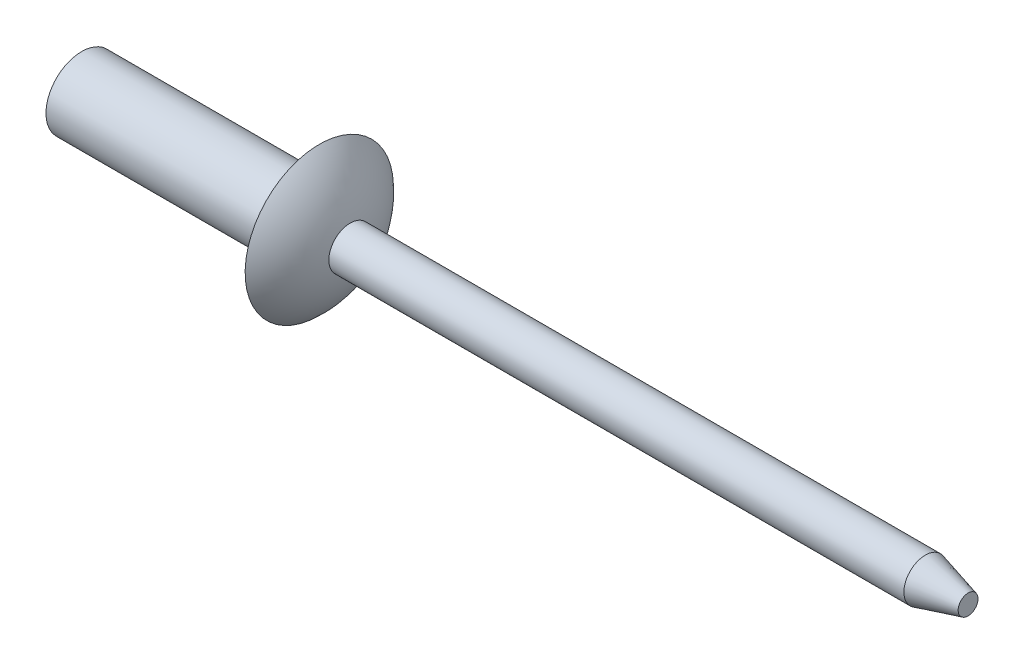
ISO-10303-21;
HEADER;
FILE_DESCRIPTION(('STEP AP214'),'2;1');
FILE_NAME('part.step','',(''),(''),'','','');
FILE_SCHEMA(('AUTOMOTIVE_DESIGN { 1 0 10303 214 1 1 1 1 }'));
ENDSEC;
DATA;
#1=APPLICATION_CONTEXT('core data for automotive mechanical design processes');
#2=APPLICATION_PROTOCOL_DEFINITION('international standard','automotive_design',2000,#1);
#3=PRODUCT_CONTEXT('',#1,'mechanical');
#4=PRODUCT('Part','Part','',(#3));
#5=PRODUCT_RELATED_PRODUCT_CATEGORY('part','',(#4));
#6=PRODUCT_DEFINITION_FORMATION('','',#4);
#7=PRODUCT_DEFINITION_CONTEXT('part definition',#1,'design');
#8=PRODUCT_DEFINITION('design','',#6,#7);
#9=PRODUCT_DEFINITION_SHAPE('','',#8);
#10=(LENGTH_UNIT() NAMED_UNIT(*) SI_UNIT(.MILLI.,.METRE.));
#11=(NAMED_UNIT(*) PLANE_ANGLE_UNIT() SI_UNIT($,.RADIAN.));
#12=(NAMED_UNIT(*) SI_UNIT($,.STERADIAN.) SOLID_ANGLE_UNIT());
#13=UNCERTAINTY_MEASURE_WITH_UNIT(LENGTH_MEASURE(1.E-05),#10,'distance_accuracy_value','');
#14=(GEOMETRIC_REPRESENTATION_CONTEXT(3) GLOBAL_UNCERTAINTY_ASSIGNED_CONTEXT((#13)) GLOBAL_UNIT_ASSIGNED_CONTEXT((#10,
#11,#12)) REPRESENTATION_CONTEXT('',''));
#15=CARTESIAN_POINT('',(0.,0.,0.));
#16=DIRECTION('',(0.,0.,1.));
#17=DIRECTION('',(1.,0.,0.));
#18=AXIS2_PLACEMENT_3D('',#15,#16,#17);
#19=CARTESIAN_POINT('',(0.,0.,0.));
#20=DIRECTION('',(1.,0.,0.));
#21=DIRECTION('',(0.,1.,0.));
#22=AXIS2_PLACEMENT_3D('',#19,#20,#21);
#23=PLANE('',#22);
#24=CARTESIAN_POINT('',(0.,0.,0.));
#25=DIRECTION('',(1.,0.,0.));
#26=DIRECTION('',(0.,1.,0.));
#27=AXIS2_PLACEMENT_3D('',#24,#25,#26);
#28=CIRCLE('',#27,1.5);
#29=CARTESIAN_POINT('',(0.,1.5,0.));
#30=VERTEX_POINT('',#29);
#31=EDGE_CURVE('E60',#30,#30,#28,.T.);
#32=ORIENTED_EDGE('',*,*,#31,.F.);
#33=EDGE_LOOP('',(#32));
#34=FACE_BOUND('',#33,.T.);
#35=ADVANCED_FACE('F40',(#34),#23,.F.);
#36=CARTESIAN_POINT('',(22.7342318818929,0.,0.));
#37=DIRECTION('',(1.,0.,0.));
#38=DIRECTION('',(0.,1.,0.));
#39=AXIS2_PLACEMENT_3D('',#36,#37,#38);
#40=CYLINDRICAL_SURFACE('',#39,1.5);
#41=CARTESIAN_POINT('',(9.5,0.,0.));
#42=DIRECTION('',(1.,0.,0.));
#43=DIRECTION('',(0.,1.,0.));
#44=AXIS2_PLACEMENT_3D('',#41,#42,#43);
#45=CIRCLE('',#44,1.5);
#46=CARTESIAN_POINT('',(9.5,1.5,0.));
#47=VERTEX_POINT('',#46);
#48=EDGE_CURVE('E48',#47,#47,#45,.F.);
#49=ORIENTED_EDGE('',*,*,#48,.T.);
#50=EDGE_LOOP('',(#49));
#51=FACE_BOUND('',#50,.T.);
#52=ORIENTED_EDGE('',*,*,#31,.T.);
#53=EDGE_LOOP('',(#52));
#54=FACE_BOUND('',#53,.T.);
#55=ADVANCED_FACE('F80',(#51,#54),#40,.T.);
#56=CARTESIAN_POINT('',(10.,-1.5,0.));
#57=DIRECTION('',(1.,0.,0.));
#58=DIRECTION('',(0.,1.,0.));
#59=AXIS2_PLACEMENT_3D('',#56,#57,#58);
#60=PLANE('',#59);
#61=CARTESIAN_POINT('',(10.,0.,0.));
#62=DIRECTION('',(1.,0.,0.));
#63=DIRECTION('',(0.,1.,0.));
#64=AXIS2_PLACEMENT_3D('',#61,#62,#63);
#65=CIRCLE('',#64,2.);
#66=CARTESIAN_POINT('',(10.,2.,0.));
#67=VERTEX_POINT('',#66);
#68=EDGE_CURVE('E55',#67,#67,#65,.T.);
#69=ORIENTED_EDGE('',*,*,#68,.T.);
#70=EDGE_LOOP('',(#69));
#71=FACE_BOUND('',#70,.T.);
#72=CARTESIAN_POINT('',(10.,0.,0.));
#73=DIRECTION('',(1.,0.,0.));
#74=DIRECTION('',(0.,1.,0.));
#75=AXIS2_PLACEMENT_3D('',#72,#73,#74);
#76=CIRCLE('',#75,3.11999999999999);
#77=CARTESIAN_POINT('',(10.,-3.11999999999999,0.));
#78=VERTEX_POINT('',#77);
#79=EDGE_CURVE('E58',#78,#78,#76,.T.);
#80=ORIENTED_EDGE('',*,*,#79,.F.);
#81=EDGE_LOOP('',(#80));
#82=FACE_BOUND('',#81,.T.);
#83=ADVANCED_FACE('F74',(#71,#82),#60,.F.);
#84=CARTESIAN_POINT('',(7.22342857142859,0.,0.));
#85=DIRECTION('',(1.,0.,0.));
#86=DIRECTION('',(0.,-1.,0.));
#87=AXIS2_PLACEMENT_3D('',#84,#85,#86);
#88=SPHERICAL_SURFACE('',#87,4.17657142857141);
#89=CARTESIAN_POINT('',(11.3018778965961,0.,0.));
#90=DIRECTION('',(1.,0.,0.));
#91=DIRECTION('',(0.,1.,0.));
#92=AXIS2_PLACEMENT_3D('',#89,#90,#91);
#93=CIRCLE('',#92,0.900000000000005);
#94=CARTESIAN_POINT('',(11.3018778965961,-0.900000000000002,0.));
#95=VERTEX_POINT('',#94);
#96=EDGE_CURVE('E62',#95,#95,#93,.T.);
#97=CARTESIAN_POINT('',(11.3018778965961,-0.900000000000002,0.));
#98=CARTESIAN_POINT('',(11.2960055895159,-0.92661117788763,0.));
#99=CARTESIAN_POINT('',(11.289872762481,-0.953164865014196,0.));
#100=CARTESIAN_POINT('',(11.2770885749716,-1.00614712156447,0.));
#101=CARTESIAN_POINT('',(11.270437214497,-1.03257569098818,0.));
#102=CARTESIAN_POINT('',(11.2566184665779,-1.085297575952,0.));
#103=CARTESIAN_POINT('',(11.2494510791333,-1.11159089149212,0.));
#104=CARTESIAN_POINT('',(11.2346030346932,-1.16403219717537,0.));
#105=CARTESIAN_POINT('',(11.2269223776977,-1.1901801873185,0.));
#106=CARTESIAN_POINT('',(11.2110507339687,-1.24232082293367,0.));
#107=CARTESIAN_POINT('',(11.2028597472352,-1.2683134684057,0.));
#108=CARTESIAN_POINT('',(11.1859705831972,-1.32013345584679,0.));
#109=CARTESIAN_POINT('',(11.1772724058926,-1.34596079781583,0.));
#110=CARTESIAN_POINT('',(11.159372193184,-1.39744028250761,0.));
#111=CARTESIAN_POINT('',(11.1501701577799,-1.42309242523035,0.));
#112=CARTESIAN_POINT('',(11.1312657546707,-1.47421168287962,0.));
#113=CARTESIAN_POINT('',(11.1215633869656,-1.49967879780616,0.));
#114=CARTESIAN_POINT('',(11.1016620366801,-1.5504182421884,0.));
#115=CARTESIAN_POINT('',(11.0914630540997,-1.57569057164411,0.));
#116=CARTESIAN_POINT('',(11.0705723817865,-1.62603076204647,0.));
#117=CARTESIAN_POINT('',(11.0598806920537,-1.65109862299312,0.));
#118=CARTESIAN_POINT('',(11.0380087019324,-1.70102027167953,0.));
#119=CARTESIAN_POINT('',(11.0268284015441,-1.72587405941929,0.));
#120=CARTESIAN_POINT('',(11.0039834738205,-1.77535803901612,0.));
#121=CARTESIAN_POINT('',(10.9923188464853,-1.79998823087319,0.));
#122=CARTESIAN_POINT('',(10.968509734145,-1.84901558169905,0.));
#123=CARTESIAN_POINT('',(10.9563652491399,-1.87341274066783,0.));
#124=CARTESIAN_POINT('',(10.9316010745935,-1.92196467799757,0.));
#125=CARTESIAN_POINT('',(10.9189813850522,-1.94611945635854,0.));
#126=CARTESIAN_POINT('',(10.8932716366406,-1.99417737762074,0.));
#127=CARTESIAN_POINT('',(10.8801815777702,-2.01808052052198,0.));
#128=CARTESIAN_POINT('',(10.8535361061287,-2.0656260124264,0.));
#129=CARTESIAN_POINT('',(10.8399806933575,-2.08926836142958,0.));
#130=CARTESIAN_POINT('',(10.8124097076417,-2.1362832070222,0.));
#131=CARTESIAN_POINT('',(10.7983941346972,-2.15965570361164,0.));
#132=CARTESIAN_POINT('',(10.7699081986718,-2.20612188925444,0.));
#133=CARTESIAN_POINT('',(10.7554378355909,-2.22921557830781,0.));
#134=CARTESIAN_POINT('',(10.7260478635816,-2.27511530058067,0.));
#135=CARTESIAN_POINT('',(10.7111282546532,-2.29792133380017,0.));
#136=CARTESIAN_POINT('',(10.6808455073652,-2.3432370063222,0.));
#137=CARTESIAN_POINT('',(10.6654823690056,-2.36574664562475,0.));
#138=CARTESIAN_POINT('',(10.634318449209,-2.41046090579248,0.));
#139=CARTESIAN_POINT('',(10.618517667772,-2.43266552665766,0.));
#140=CARTESIAN_POINT('',(10.5864845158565,-2.47676124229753,0.));
#141=CARTESIAN_POINT('',(10.5702521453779,-2.4986523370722,0.));
#142=CARTESIAN_POINT('',(10.5373620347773,-2.54211261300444,0.));
#143=CARTESIAN_POINT('',(10.5207042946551,-2.563681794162,0.));
#144=CARTESIAN_POINT('',(10.4869698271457,-2.60648997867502,0.));
#145=CARTESIAN_POINT('',(10.4698930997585,-2.62772898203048,0.));
#146=CARTESIAN_POINT('',(10.4353272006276,-2.6698686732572,0.));
#147=CARTESIAN_POINT('',(10.4178380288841,-2.69076936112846,0.));
#148=CARTESIAN_POINT('',(10.3824539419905,-2.73222441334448,0.));
#149=CARTESIAN_POINT('',(10.3645590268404,-2.75277877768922,0.));
#150=CARTESIAN_POINT('',(10.3283703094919,-2.79353330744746,0.));
#151=CARTESIAN_POINT('',(10.3100765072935,-2.81373347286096,0.));
#152=CARTESIAN_POINT('',(10.2730970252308,-2.8537718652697,0.));
#153=CARTESIAN_POINT('',(10.2544113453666,-2.87361009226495,0.));
#154=CARTESIAN_POINT('',(10.2166552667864,-2.912917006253,0.));
#155=CARTESIAN_POINT('',(10.1975848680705,-2.9323856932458,0.));
#156=CARTESIAN_POINT('',(10.159066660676,-2.97094607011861,0.));
#157=CARTESIAN_POINT('',(10.1396188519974,-2.99003775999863,0.));
#158=CARTESIAN_POINT('',(10.100353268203,-3.0278368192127,0.));
#159=CARTESIAN_POINT('',(10.080535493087,-3.04654418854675,0.));
#160=CARTESIAN_POINT('',(10.0405375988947,-3.08356747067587,0.));
#161=CARTESIAN_POINT('',(10.0203574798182,-3.10188338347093,0.));
#162=CARTESIAN_POINT('',(10.,-3.11999999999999,0.));
#163=B_SPLINE_CURVE_WITH_KNOTS('',3,(#97,#98,#99,#100,#101,#102,#103,#104,#105,#106,#107,#108,
#109,#110,#111,#112,#113,#114,#115,#116,#117,#118,#119,#120,#121,#122,#123,#124,#125,#126,#127,
#128,#129,#130,#131,#132,#133,#134,#135,#136,#137,#138,#139,#140,#141,#142,#143,#144,#145,#146,
#147,#148,#149,#150,#151,#152,#153,#154,#155,#156,#157,#158,#159,#160,#161,#162),.UNSPECIFIED.,
.F.,.F.,(4,2,2,2,2,2,2,2,2,2,2,2,2,2,2,2,2,2,2,2,2,2,2,2,2,2,2,2,2,2,2,2,4),(0.,
0.081752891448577,0.163505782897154,0.245258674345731,0.327011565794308,0.408764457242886,
0.490517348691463,0.57227024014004,0.654023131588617,0.735776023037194,0.817528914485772,
0.899281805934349,0.981034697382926,1.0627875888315,1.14454048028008,1.22629337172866,
1.30804626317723,1.38979915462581,1.47155204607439,1.55330493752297,1.63505782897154,
1.71681072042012,1.7985636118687,1.88031650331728,1.96206939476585,2.04382228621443,
2.12557517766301,2.20732806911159,2.28908096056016,2.37083385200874,2.45258674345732,
2.53433963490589,2.61609252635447),.UNSPECIFIED.);
#164=EDGE_CURVE('BSEAM68',#95,#78,#163,.T.);
#165=ORIENTED_EDGE('',*,*,#96,.F.);
#166=ORIENTED_EDGE('',*,*,#79,.T.);
#167=ORIENTED_EDGE('',*,*,#164,.T.);
#168=ORIENTED_EDGE('',*,*,#164,.F.);
#169=EDGE_LOOP('',(#165,#167,#166,#168));
#170=FACE_BOUND('',#169,.T.);
#171=ADVANCED_FACE('F68',(#170),#88,.T.);
#172=CARTESIAN_POINT('',(22.7342318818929,0.,0.));
#173=DIRECTION('',(1.,0.,0.));
#174=DIRECTION('',(0.,1.,0.));
#175=AXIS2_PLACEMENT_3D('',#172,#173,#174);
#176=CYLINDRICAL_SURFACE('',#175,0.900000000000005);
#177=CARTESIAN_POINT('',(35.501877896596,0.,0.));
#178=DIRECTION('',(-1.,0.,0.));
#179=DIRECTION('',(0.,-1.,0.));
#180=AXIS2_PLACEMENT_3D('',#177,#178,#179);
#181=CIRCLE('',#180,0.900000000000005);
#182=CARTESIAN_POINT('',(35.501877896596,-0.900000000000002,0.));
#183=VERTEX_POINT('',#182);
#184=EDGE_CURVE('E10',#183,#183,#181,.T.);
#185=ORIENTED_EDGE('',*,*,#184,.T.);
#186=EDGE_LOOP('',(#185));
#187=FACE_BOUND('',#186,.T.);
#188=ORIENTED_EDGE('',*,*,#96,.T.);
#189=EDGE_LOOP('',(#188));
#190=FACE_BOUND('',#189,.T.);
#191=ADVANCED_FACE('F70',(#187,#190),#176,.T.);
#192=CARTESIAN_POINT('',(37.3018778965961,-0.900000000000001,0.));
#193=DIRECTION('',(-1.,0.,0.));
#194=DIRECTION('',(0.,-1.,0.));
#195=AXIS2_PLACEMENT_3D('',#192,#193,#194);
#196=PLANE('',#195);
#197=CARTESIAN_POINT('',(37.3018778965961,0.,0.));
#198=DIRECTION('',(-1.,0.,0.));
#199=DIRECTION('',(0.,-1.,0.));
#200=AXIS2_PLACEMENT_3D('',#197,#198,#199);
#201=CIRCLE('',#200,0.417691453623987);
#202=CARTESIAN_POINT('',(37.3018778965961,-0.417691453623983,0.));
#203=VERTEX_POINT('',#202);
#204=EDGE_CURVE('E42',#203,#203,#201,.F.);
#205=ORIENTED_EDGE('',*,*,#204,.T.);
#206=EDGE_LOOP('',(#205));
#207=FACE_BOUND('',#206,.T.);
#208=ADVANCED_FACE('F92',(#207),#196,.F.);
#209=CARTESIAN_POINT('',(9.5,0.,0.));
#210=DIRECTION('',(1.,0.,0.));
#211=DIRECTION('',(0.,1.,0.));
#212=AXIS2_PLACEMENT_3D('',#209,#210,#211);
#213=TOROIDAL_SURFACE('',#212,2.,0.5);
#214=ORIENTED_EDGE('',*,*,#48,.F.);
#215=EDGE_LOOP('',(#214));
#216=FACE_BOUND('',#215,.T.);
#217=ORIENTED_EDGE('',*,*,#68,.F.);
#218=EDGE_LOOP('',(#217));
#219=FACE_BOUND('',#218,.T.);
#220=ADVANCED_FACE('F94',(#216,#219),#213,.F.);
#221=CARTESIAN_POINT('',(37.3018778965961,0.,0.));
#222=DIRECTION('',(-1.,0.,0.));
#223=DIRECTION('',(0.,-1.,0.));
#224=AXIS2_PLACEMENT_3D('',#221,#222,#223);
#225=CONICAL_SURFACE('',#224,0.417691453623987,0.261799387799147);
#226=ORIENTED_EDGE('',*,*,#184,.F.);
#227=EDGE_LOOP('',(#226));
#228=FACE_BOUND('',#227,.T.);
#229=ORIENTED_EDGE('',*,*,#204,.F.);
#230=EDGE_LOOP('',(#229));
#231=FACE_BOUND('',#230,.T.);
#232=ADVANCED_FACE('F39',(#228,#231),#225,.T.);
#233=CLOSED_SHELL('',(#35,#55,#83,#171,#191,#208,#220,#232));
#234=MANIFOLD_SOLID_BREP('B2',#233);
#235=ADVANCED_BREP_SHAPE_REPRESENTATION('',(#18,#234),#14);
#236=SHAPE_DEFINITION_REPRESENTATION(#9,#235);
ENDSEC;
END-ISO-10303-21;
